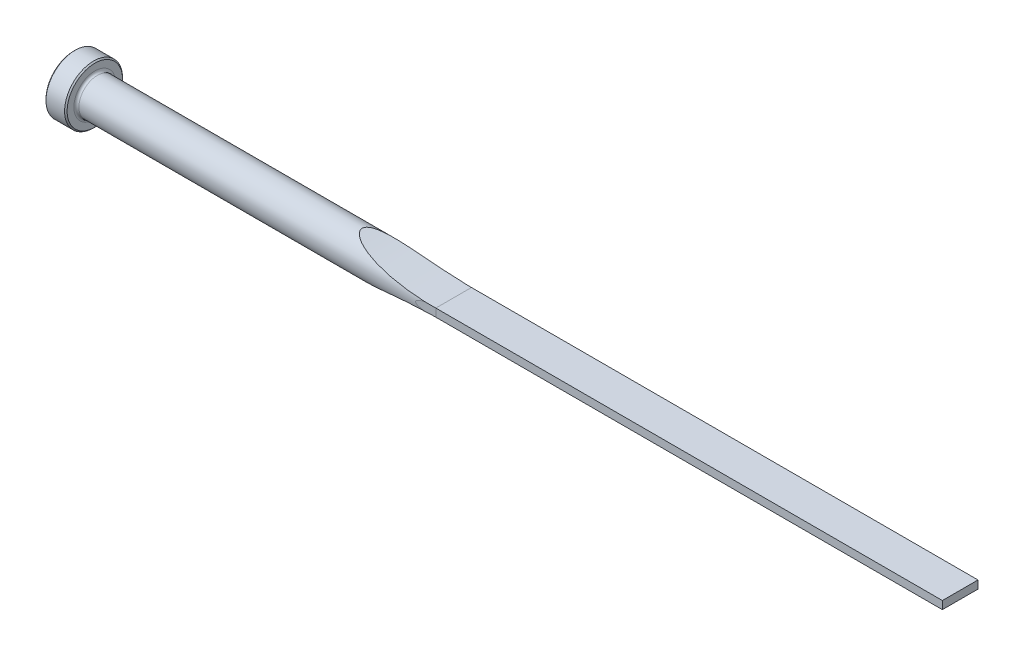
from build123d import *

# Parameters (mm, degrees)
CUT_EXTRUDE1_DEPTH = 267.985276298
CUT_EXTRUDE2_DEPTH = 267.985276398
FILLET1_R          = 0.762
CHAMFER1_SIZE      = 0.381


with BuildPart() as part:
    # Sketch1 → Revolve1 (revolve)
    with BuildSketch(Plane.XY, mode=Mode.PRIVATE) as revolve1_sk:
        Polygon((0, 0), (0, 8.7249), (6.35, 8.7249), (6.35, 5.55625), (266.7, 5.55625), (266.7, 0), align=None)
    revolve(revolve1_sk.sketch.rotate(Axis((0, 0, 0), (1, 0, 0)), 90), axis=Axis((0, 0, 0), (1, 0, 0)))

    # Sketch2 → Cut-Extrude1 (cut, symmetric)
    with BuildSketch(Plane.XY):
        with BuildLine():
            Line((266.7, 5.55625), (266.7, 1.1938))
            Line((266.7, 1.1938), (114.3, 1.1938))
            ThreePointArc((114.3, 1.1938), (100.374810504, 2.291185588), (86.793407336, 5.55625))
            Line((86.793407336, 5.55625), (266.7, 5.55625))
        make_face()
    cut_extrude1 = extrude(amount=CUT_EXTRUDE1_DEPTH, both=True, mode=Mode.SUBTRACT)

    # Mirror1: Cut-Extrude1 across plane
    add(cut_extrude1.mirror(Plane.ZX), mode=Mode.SUBTRACT)

    # Sketch3 → Cut-Extrude2 (cut, symmetric)
    with BuildSketch(Plane(origin=(0, 0, 0), x_dir=(1, 0, 0), z_dir=(0, 1, 0))):
        with BuildLine():
            Line((266.7, 5.55625), (266.7, 5.3594))
            Line((266.7, 5.3594), (114.3, 5.3594))
            ThreePointArc((114.3, 5.3594), (111.341963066, 5.408626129), (108.387202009, 5.55625))
            Line((108.387202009, 5.55625), (266.7, 5.55625))
        make_face()
    cut_extrude2 = extrude(amount=CUT_EXTRUDE2_DEPTH, both=True, mode=Mode.SUBTRACT)

    # Mirror2: Cut-Extrude2 across plane
    add(cut_extrude2.mirror(Plane.XY), mode=Mode.SUBTRACT)

    # Fillet1
    fillet1_edges = [part.edges().sort_by_distance(p)[0] for p in [
        (6.35, 0, -5.55625),
    ]]
    fillet(fillet1_edges, radius=FILLET1_R)

    # Chamfer1
    chamfer1_edges = [part.edges().sort_by_distance(p)[0] for p in [
        (6.35, 0, -8.7249),
        (0, 0, -8.7249),
    ]]
    chamfer(chamfer1_edges, length=CHAMFER1_SIZE)


solid = part.part
